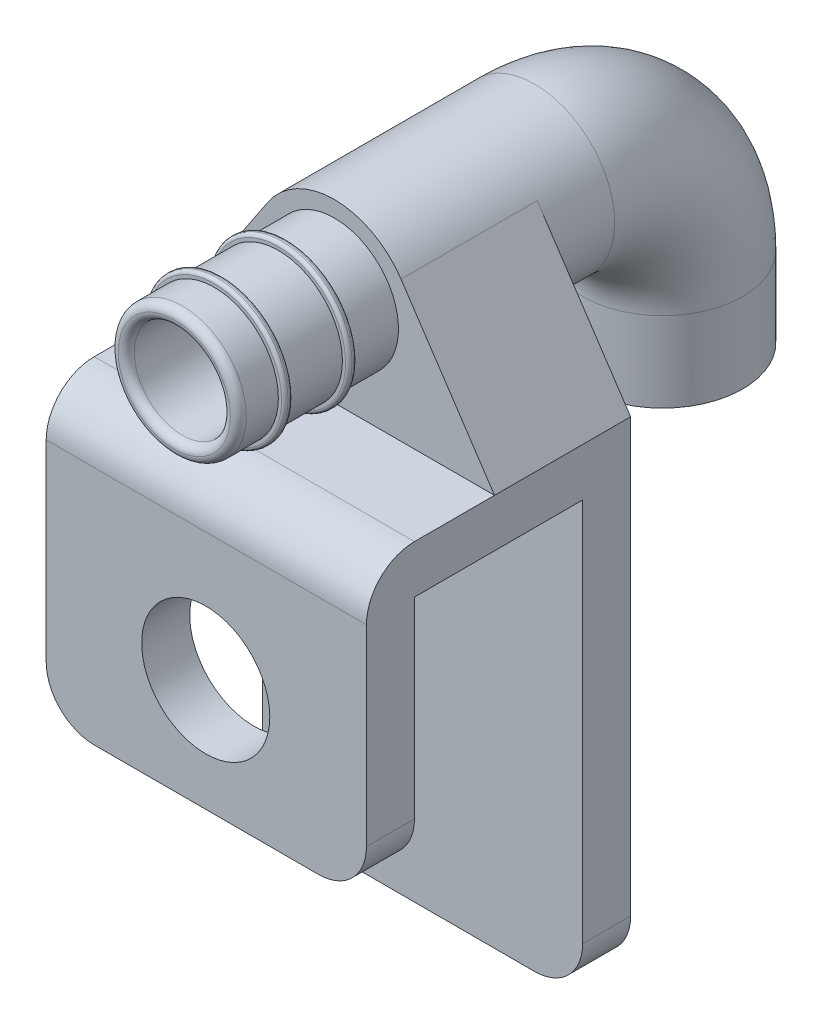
ISO-10303-21;
HEADER;
FILE_DESCRIPTION(('STEP AP214'),'2;1');
FILE_NAME('part.step','',(''),(''),'','','');
FILE_SCHEMA(('AUTOMOTIVE_DESIGN { 1 0 10303 214 1 1 1 1 }'));
ENDSEC;
DATA;
#1=APPLICATION_CONTEXT('core data for automotive mechanical design processes');
#2=APPLICATION_PROTOCOL_DEFINITION('international standard','automotive_design',2000,#1);
#3=PRODUCT_CONTEXT('',#1,'mechanical');
#4=PRODUCT('Part','Part','',(#3));
#5=PRODUCT_RELATED_PRODUCT_CATEGORY('part','',(#4));
#6=PRODUCT_DEFINITION_FORMATION('','',#4);
#7=PRODUCT_DEFINITION_CONTEXT('part definition',#1,'design');
#8=PRODUCT_DEFINITION('design','',#6,#7);
#9=PRODUCT_DEFINITION_SHAPE('','',#8);
#10=(LENGTH_UNIT() NAMED_UNIT(*) SI_UNIT(.MILLI.,.METRE.));
#11=(NAMED_UNIT(*) PLANE_ANGLE_UNIT() SI_UNIT($,.RADIAN.));
#12=(NAMED_UNIT(*) SI_UNIT($,.STERADIAN.) SOLID_ANGLE_UNIT());
#13=UNCERTAINTY_MEASURE_WITH_UNIT(LENGTH_MEASURE(1.E-05),#10,'distance_accuracy_value','');
#14=(GEOMETRIC_REPRESENTATION_CONTEXT(3) GLOBAL_UNCERTAINTY_ASSIGNED_CONTEXT((#13)) GLOBAL_UNIT_ASSIGNED_CONTEXT((#10,
#11,#12)) REPRESENTATION_CONTEXT('',''));
#15=CARTESIAN_POINT('',(0.,0.,0.));
#16=DIRECTION('',(0.,0.,1.));
#17=DIRECTION('',(1.,0.,0.));
#18=AXIS2_PLACEMENT_3D('',#15,#16,#17);
#19=CARTESIAN_POINT('',(20.,-12.,-13.5));
#20=DIRECTION('',(0.,0.,1.));
#21=DIRECTION('',(1.,0.,0.));
#22=AXIS2_PLACEMENT_3D('',#19,#20,#21);
#23=PLANE('',#22);
#24=DIRECTION('',(-1.,0.,0.));
#25=VECTOR('',#24,1.);
#26=CARTESIAN_POINT('',(20.,-12.,-13.5));
#27=LINE('',#26,#25);
#28=CARTESIAN_POINT('',(17.,-12.,-13.5));
#29=VERTEX_POINT('',#28);
#30=CARTESIAN_POINT('',(3.,-12.,-13.5));
#31=VERTEX_POINT('',#30);
#32=EDGE_CURVE('E279',#29,#31,#27,.T.);
#33=ORIENTED_EDGE('',*,*,#32,.T.);
#34=CARTESIAN_POINT('',(3.,-9.,-13.5));
#35=DIRECTION('',(0.,0.,1.));
#36=DIRECTION('',(1.,0.,0.));
#37=AXIS2_PLACEMENT_3D('',#34,#35,#36);
#38=CIRCLE('',#37,3.);
#39=CARTESIAN_POINT('',(0.,-9.,-13.5));
#40=VERTEX_POINT('',#39);
#41=EDGE_CURVE('E344',#31,#40,#38,.F.);
#42=ORIENTED_EDGE('',*,*,#41,.T.);
#43=DIRECTION('',(0.,1.,0.));
#44=VECTOR('',#43,1.);
#45=CARTESIAN_POINT('',(0.,-12.,-13.5));
#46=LINE('',#45,#44);
#47=CARTESIAN_POINT('',(0.,18.,-13.5));
#48=VERTEX_POINT('',#47);
#49=EDGE_CURVE('E161',#40,#48,#46,.T.);
#50=ORIENTED_EDGE('',*,*,#49,.T.);
#51=DIRECTION('',(0.55409218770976,0.832455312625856,0.));
#52=VECTOR('',#51,1.);
#53=CARTESIAN_POINT('',(0.,18.,-13.5));
#54=LINE('',#53,#52);
#55=CARTESIAN_POINT('',(5.83772343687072,26.7704609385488,-13.5));
#56=VERTEX_POINT('',#55);
#57=EDGE_CURVE('E145',#48,#56,#54,.T.);
#58=ORIENTED_EDGE('',*,*,#57,.T.);
#59=CARTESIAN_POINT('',(10.,24.,-13.5));
#60=DIRECTION('',(0.,0.,-1.));
#61=DIRECTION('',(-1.,0.,0.));
#62=AXIS2_PLACEMENT_3D('',#59,#60,#61);
#63=CIRCLE('',#62,5.);
#64=CARTESIAN_POINT('',(14.1622765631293,26.7704609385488,-13.5));
#65=VERTEX_POINT('',#64);
#66=EDGE_CURVE('E158',#65,#56,#63,.T.);
#67=ORIENTED_EDGE('',*,*,#66,.F.);
#68=DIRECTION('',(0.55409218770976,-0.832455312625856,0.));
#69=VECTOR('',#68,1.);
#70=CARTESIAN_POINT('',(14.1622765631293,26.7704609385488,-13.5));
#71=LINE('',#70,#69);
#72=CARTESIAN_POINT('',(20.,18.,-13.5));
#73=VERTEX_POINT('',#72);
#74=EDGE_CURVE('E164',#65,#73,#71,.T.);
#75=ORIENTED_EDGE('',*,*,#74,.T.);
#76=DIRECTION('',(0.,1.,0.));
#77=VECTOR('',#76,1.);
#78=CARTESIAN_POINT('',(20.,-12.,-13.5));
#79=LINE('',#78,#77);
#80=CARTESIAN_POINT('',(20.,-9.,-13.5));
#81=VERTEX_POINT('',#80);
#82=EDGE_CURVE('E267',#81,#73,#79,.T.);
#83=ORIENTED_EDGE('',*,*,#82,.F.);
#84=CARTESIAN_POINT('',(17.,-9.,-13.5));
#85=DIRECTION('',(0.,0.,1.));
#86=DIRECTION('',(1.,0.,0.));
#87=AXIS2_PLACEMENT_3D('',#84,#85,#86);
#88=CIRCLE('',#87,3.);
#89=EDGE_CURVE('E346',#81,#29,#88,.F.);
#90=ORIENTED_EDGE('',*,*,#89,.T.);
#91=EDGE_LOOP('',(#33,#42,#50,#58,#67,#75,#83,#90));
#92=FACE_BOUND('',#91,.T.);
#93=ADVANCED_FACE('F27',(#92),#23,.F.);
#94=CARTESIAN_POINT('',(10.,24.,5.));
#95=DIRECTION('',(0.,0.,-1.));
#96=DIRECTION('',(-1.,0.,0.));
#97=AXIS2_PLACEMENT_3D('',#94,#95,#96);
#98=CYLINDRICAL_SURFACE('',#97,4.);
#99=CARTESIAN_POINT('',(10.,24.,-1.5));
#100=DIRECTION('',(0.,0.,1.));
#101=DIRECTION('',(1.,0.,0.));
#102=AXIS2_PLACEMENT_3D('',#99,#100,#101);
#103=CIRCLE('',#102,4.);
#104=CARTESIAN_POINT('',(14.,24.,-1.5));
#105=VERTEX_POINT('',#104);
#106=EDGE_CURVE('E204',#105,#105,#103,.T.);
#107=ORIENTED_EDGE('',*,*,#106,.T.);
#108=EDGE_LOOP('',(#107));
#109=FACE_BOUND('',#108,.T.);
#110=CARTESIAN_POINT('',(10.,24.,2.));
#111=DIRECTION('',(0.,0.,1.));
#112=DIRECTION('',(1.,0.,0.));
#113=AXIS2_PLACEMENT_3D('',#110,#111,#112);
#114=CIRCLE('',#113,4.);
#115=CARTESIAN_POINT('',(14.,24.,2.));
#116=VERTEX_POINT('',#115);
#117=EDGE_CURVE('E200',#116,#116,#114,.T.);
#118=ORIENTED_EDGE('',*,*,#117,.F.);
#119=EDGE_LOOP('',(#118));
#120=FACE_BOUND('',#119,.T.);
#121=ADVANCED_FACE('F409',(#109,#120),#98,.T.);
#122=CARTESIAN_POINT('',(10.,24.,-5.));
#123=DIRECTION('',(0.,0.,-1.));
#124=DIRECTION('',(-1.,0.,0.));
#125=AXIS2_PLACEMENT_3D('',#122,#123,#124);
#126=CIRCLE('',#125,4.);
#127=CARTESIAN_POINT('',(6.,24.,-5.));
#128=VERTEX_POINT('',#127);
#129=EDGE_CURVE('E226',#128,#128,#126,.F.);
#130=ORIENTED_EDGE('',*,*,#129,.T.);
#131=EDGE_LOOP('',(#130));
#132=FACE_BOUND('',#131,.T.);
#133=CARTESIAN_POINT('',(10.,24.,-2.));
#134=DIRECTION('',(0.,0.,1.));
#135=DIRECTION('',(1.,0.,0.));
#136=AXIS2_PLACEMENT_3D('',#133,#134,#135);
#137=CIRCLE('',#136,4.);
#138=CARTESIAN_POINT('',(14.,24.,-2.));
#139=VERTEX_POINT('',#138);
#140=EDGE_CURVE('E220',#139,#139,#137,.T.);
#141=ORIENTED_EDGE('',*,*,#140,.F.);
#142=EDGE_LOOP('',(#141));
#143=FACE_BOUND('',#142,.T.);
#144=ADVANCED_FACE('F416',(#132,#143),#98,.T.);
#145=CARTESIAN_POINT('',(10.,24.,-5.));
#146=DIRECTION('',(0.,0.,-1.));
#147=DIRECTION('',(-1.,0.,0.));
#148=AXIS2_PLACEMENT_3D('',#145,#146,#147);
#149=PLANE('',#148);
#150=CARTESIAN_POINT('',(10.,24.,-5.));
#151=DIRECTION('',(0.,0.,1.));
#152=DIRECTION('',(-1.,0.,0.));
#153=AXIS2_PLACEMENT_3D('',#150,#151,#152);
#154=CIRCLE('',#153,5.);
#155=CARTESIAN_POINT('',(14.1622765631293,26.7704609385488,-5.));
#156=VERTEX_POINT('',#155);
#157=CARTESIAN_POINT('',(5.83772343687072,26.7704609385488,-5.));
#158=VERTEX_POINT('',#157);
#159=EDGE_CURVE('E223',#156,#158,#154,.T.);
#160=ORIENTED_EDGE('',*,*,#159,.T.);
#161=DIRECTION('',(-0.55409218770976,-0.832455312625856,0.));
#162=VECTOR('',#161,1.);
#163=CARTESIAN_POINT('',(0.,18.,-5.));
#164=LINE('',#163,#162);
#165=CARTESIAN_POINT('',(0.,18.,-5.));
#166=VERTEX_POINT('',#165);
#167=EDGE_CURVE('E147',#158,#166,#164,.T.);
#168=ORIENTED_EDGE('',*,*,#167,.T.);
#169=DIRECTION('',(1.,0.,0.));
#170=VECTOR('',#169,1.);
#171=CARTESIAN_POINT('',(20.,18.,-5.));
#172=LINE('',#171,#170);
#173=CARTESIAN_POINT('',(20.,18.,-5.));
#174=VERTEX_POINT('',#173);
#175=EDGE_CURVE('E233',#166,#174,#172,.T.);
#176=ORIENTED_EDGE('',*,*,#175,.T.);
#177=DIRECTION('',(-0.55409218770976,0.832455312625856,0.));
#178=VECTOR('',#177,1.);
#179=CARTESIAN_POINT('',(14.1622765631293,26.7704609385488,-5.));
#180=LINE('',#179,#178);
#181=EDGE_CURVE('E153',#174,#156,#180,.T.);
#182=ORIENTED_EDGE('',*,*,#181,.T.);
#183=EDGE_LOOP('',(#160,#168,#176,#182));
#184=FACE_BOUND('',#183,.T.);
#185=ORIENTED_EDGE('',*,*,#129,.F.);
#186=EDGE_LOOP('',(#185));
#187=FACE_BOUND('',#186,.T.);
#188=ADVANCED_FACE('F358',(#184,#187),#149,.F.);
#189=CARTESIAN_POINT('',(20.,18.,3.));
#190=DIRECTION('',(0.,-1.,0.));
#191=DIRECTION('',(0.,0.,-1.));
#192=AXIS2_PLACEMENT_3D('',#189,#190,#191);
#193=PLANE('',#192);
#194=DIRECTION('',(0.,0.,1.));
#195=VECTOR('',#194,1.);
#196=CARTESIAN_POINT('',(0.,18.,3.));
#197=LINE('',#196,#195);
#198=CARTESIAN_POINT('',(0.,18.,0.));
#199=VERTEX_POINT('',#198);
#200=EDGE_CURVE('E255',#166,#199,#197,.T.);
#201=ORIENTED_EDGE('',*,*,#200,.T.);
#202=DIRECTION('',(-1.,0.,0.));
#203=VECTOR('',#202,1.);
#204=CARTESIAN_POINT('',(20.,18.,0.));
#205=LINE('',#204,#203);
#206=CARTESIAN_POINT('',(20.,18.,0.));
#207=VERTEX_POINT('',#206);
#208=EDGE_CURVE('E307',#199,#207,#205,.F.);
#209=ORIENTED_EDGE('',*,*,#208,.T.);
#210=DIRECTION('',(0.,0.,1.));
#211=VECTOR('',#210,1.);
#212=CARTESIAN_POINT('',(20.,18.,3.));
#213=LINE('',#212,#211);
#214=EDGE_CURVE('E265',#174,#207,#213,.T.);
#215=ORIENTED_EDGE('',*,*,#214,.F.);
#216=ORIENTED_EDGE('',*,*,#175,.F.);
#217=EDGE_LOOP('',(#201,#209,#215,#216));
#218=FACE_BOUND('',#217,.T.);
#219=ADVANCED_FACE('F319',(#218),#193,.F.);
#220=CARTESIAN_POINT('',(20.,0.,3.));
#221=DIRECTION('',(0.,1.,0.));
#222=DIRECTION('',(0.,0.,1.));
#223=AXIS2_PLACEMENT_3D('',#220,#221,#222);
#224=PLANE('',#223);
#225=DIRECTION('',(-1.,0.,0.));
#226=VECTOR('',#225,1.);
#227=CARTESIAN_POINT('',(20.,0.,0.));
#228=LINE('',#227,#226);
#229=CARTESIAN_POINT('',(17.,0.,0.));
#230=VERTEX_POINT('',#229);
#231=CARTESIAN_POINT('',(3.,0.,0.));
#232=VERTEX_POINT('',#231);
#233=EDGE_CURVE('E229',#230,#232,#228,.T.);
#234=ORIENTED_EDGE('',*,*,#233,.F.);
#235=DIRECTION('',(0.,0.,-1.));
#236=VECTOR('',#235,1.);
#237=CARTESIAN_POINT('',(17.,0.,3.));
#238=LINE('',#237,#236);
#239=CARTESIAN_POINT('',(17.,0.,3.));
#240=VERTEX_POINT('',#239);
#241=EDGE_CURVE('E11',#230,#240,#238,.F.);
#242=ORIENTED_EDGE('',*,*,#241,.T.);
#243=DIRECTION('',(-1.,0.,0.));
#244=VECTOR('',#243,1.);
#245=CARTESIAN_POINT('',(20.,0.,3.));
#246=LINE('',#245,#244);
#247=CARTESIAN_POINT('',(3.,0.,3.));
#248=VERTEX_POINT('',#247);
#249=EDGE_CURVE('E276',#240,#248,#246,.T.);
#250=ORIENTED_EDGE('',*,*,#249,.T.);
#251=DIRECTION('',(0.,0.,-1.));
#252=VECTOR('',#251,1.);
#253=CARTESIAN_POINT('',(3.,0.,3.));
#254=LINE('',#253,#252);
#255=EDGE_CURVE('E35',#248,#232,#254,.T.);
#256=ORIENTED_EDGE('',*,*,#255,.T.);
#257=EDGE_LOOP('',(#234,#242,#250,#256));
#258=FACE_BOUND('',#257,.T.);
#259=ADVANCED_FACE('F29',(#258),#224,.F.);
#260=CARTESIAN_POINT('',(20.,0.,0.));
#261=DIRECTION('',(0.,0.,1.));
#262=DIRECTION('',(1.,0.,0.));
#263=AXIS2_PLACEMENT_3D('',#260,#261,#262);
#264=PLANE('',#263);
#265=CARTESIAN_POINT('',(9.96355555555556,7.,0.));
#266=DIRECTION('',(0.,0.,1.));
#267=DIRECTION('',(1.,0.,0.));
#268=AXIS2_PLACEMENT_3D('',#265,#266,#267);
#269=CIRCLE('',#268,4.);
#270=CARTESIAN_POINT('',(13.9635555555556,7.,0.));
#271=VERTEX_POINT('',#270);
#272=EDGE_CURVE('E435',#271,#271,#269,.T.);
#273=ORIENTED_EDGE('',*,*,#272,.T.);
#274=EDGE_LOOP('',(#273));
#275=FACE_BOUND('',#274,.T.);
#276=DIRECTION('',(0.,1.,0.));
#277=VECTOR('',#276,1.);
#278=CARTESIAN_POINT('',(20.,0.,0.));
#279=LINE('',#278,#277);
#280=CARTESIAN_POINT('',(20.,3.,0.));
#281=VERTEX_POINT('',#280);
#282=CARTESIAN_POINT('',(20.,15.,0.));
#283=VERTEX_POINT('',#282);
#284=EDGE_CURVE('E366',#281,#283,#279,.T.);
#285=ORIENTED_EDGE('',*,*,#284,.F.);
#286=CARTESIAN_POINT('',(17.,3.,0.));
#287=DIRECTION('',(0.,0.,1.));
#288=DIRECTION('',(1.,0.,0.));
#289=AXIS2_PLACEMENT_3D('',#286,#287,#288);
#290=CIRCLE('',#289,3.);
#291=EDGE_CURVE('E50',#281,#230,#290,.F.);
#292=ORIENTED_EDGE('',*,*,#291,.T.);
#293=ORIENTED_EDGE('',*,*,#233,.T.);
#294=CARTESIAN_POINT('',(3.,3.,0.));
#295=DIRECTION('',(0.,0.,1.));
#296=DIRECTION('',(1.,0.,0.));
#297=AXIS2_PLACEMENT_3D('',#294,#295,#296);
#298=CIRCLE('',#297,3.);
#299=CARTESIAN_POINT('',(0.,3.,0.));
#300=VERTEX_POINT('',#299);
#301=EDGE_CURVE('E42',#232,#300,#298,.F.);
#302=ORIENTED_EDGE('',*,*,#301,.T.);
#303=DIRECTION('',(0.,1.,0.));
#304=VECTOR('',#303,1.);
#305=CARTESIAN_POINT('',(0.,0.,0.));
#306=LINE('',#305,#304);
#307=CARTESIAN_POINT('',(0.,15.,0.));
#308=VERTEX_POINT('',#307);
#309=EDGE_CURVE('E163',#300,#308,#306,.T.);
#310=ORIENTED_EDGE('',*,*,#309,.T.);
#311=DIRECTION('',(-1.,0.,0.));
#312=VECTOR('',#311,1.);
#313=CARTESIAN_POINT('',(20.,15.,0.));
#314=LINE('',#313,#312);
#315=EDGE_CURVE('E287',#283,#308,#314,.T.);
#316=ORIENTED_EDGE('',*,*,#315,.F.);
#317=EDGE_LOOP('',(#285,#292,#293,#302,#310,#316));
#318=FACE_BOUND('',#317,.T.);
#319=ADVANCED_FACE('F289',(#275,#318),#264,.F.);
#320=CARTESIAN_POINT('',(20.,15.,0.));
#321=DIRECTION('',(0.,1.,0.));
#322=DIRECTION('',(0.,0.,1.));
#323=AXIS2_PLACEMENT_3D('',#320,#321,#322);
#324=PLANE('',#323);
#325=DIRECTION('',(0.,0.,-1.));
#326=VECTOR('',#325,1.);
#327=CARTESIAN_POINT('',(0.,15.,0.));
#328=LINE('',#327,#326);
#329=CARTESIAN_POINT('',(0.,15.,-10.5));
#330=VERTEX_POINT('',#329);
#331=EDGE_CURVE('E249',#308,#330,#328,.T.);
#332=ORIENTED_EDGE('',*,*,#331,.T.);
#333=DIRECTION('',(-1.,0.,0.));
#334=VECTOR('',#333,1.);
#335=CARTESIAN_POINT('',(20.,15.,-10.5));
#336=LINE('',#335,#334);
#337=CARTESIAN_POINT('',(20.,15.,-10.5));
#338=VERTEX_POINT('',#337);
#339=EDGE_CURVE('E284',#338,#330,#336,.T.);
#340=ORIENTED_EDGE('',*,*,#339,.F.);
#341=DIRECTION('',(0.,0.,-1.));
#342=VECTOR('',#341,1.);
#343=CARTESIAN_POINT('',(20.,15.,0.));
#344=LINE('',#343,#342);
#345=EDGE_CURVE('E369',#283,#338,#344,.T.);
#346=ORIENTED_EDGE('',*,*,#345,.F.);
#347=ORIENTED_EDGE('',*,*,#315,.T.);
#348=EDGE_LOOP('',(#332,#340,#346,#347));
#349=FACE_BOUND('',#348,.T.);
#350=ADVANCED_FACE('F393',(#349),#324,.F.);
#351=CARTESIAN_POINT('',(20.,-12.,-10.5));
#352=DIRECTION('',(0.,0.,-1.));
#353=DIRECTION('',(0.,1.,0.));
#354=AXIS2_PLACEMENT_3D('',#351,#352,#353);
#355=PLANE('',#354);
#356=DIRECTION('',(0.,-1.,0.));
#357=VECTOR('',#356,1.);
#358=CARTESIAN_POINT('',(0.,-12.,-10.5));
#359=LINE('',#358,#357);
#360=CARTESIAN_POINT('',(0.,-9.,-10.5));
#361=VERTEX_POINT('',#360);
#362=EDGE_CURVE('E251',#330,#361,#359,.T.);
#363=ORIENTED_EDGE('',*,*,#362,.T.);
#364=CARTESIAN_POINT('',(3.,-9.,-10.5));
#365=DIRECTION('',(0.,0.,-1.));
#366=DIRECTION('',(0.,1.,0.));
#367=AXIS2_PLACEMENT_3D('',#364,#365,#366);
#368=CIRCLE('',#367,3.);
#369=CARTESIAN_POINT('',(3.,-12.,-10.5));
#370=VERTEX_POINT('',#369);
#371=EDGE_CURVE('E332',#361,#370,#368,.F.);
#372=ORIENTED_EDGE('',*,*,#371,.T.);
#373=DIRECTION('',(-1.,0.,0.));
#374=VECTOR('',#373,1.);
#375=CARTESIAN_POINT('',(20.,-12.,-10.5));
#376=LINE('',#375,#374);
#377=CARTESIAN_POINT('',(17.,-12.,-10.5));
#378=VERTEX_POINT('',#377);
#379=EDGE_CURVE('E281',#378,#370,#376,.T.);
#380=ORIENTED_EDGE('',*,*,#379,.F.);
#381=CARTESIAN_POINT('',(17.,-9.,-10.5));
#382=DIRECTION('',(0.,0.,-1.));
#383=DIRECTION('',(0.,1.,0.));
#384=AXIS2_PLACEMENT_3D('',#381,#382,#383);
#385=CIRCLE('',#384,3.);
#386=CARTESIAN_POINT('',(20.,-9.,-10.5));
#387=VERTEX_POINT('',#386);
#388=EDGE_CURVE('E336',#378,#387,#385,.F.);
#389=ORIENTED_EDGE('',*,*,#388,.T.);
#390=DIRECTION('',(0.,-1.,0.));
#391=VECTOR('',#390,1.);
#392=CARTESIAN_POINT('',(20.,-12.,-10.5));
#393=LINE('',#392,#391);
#394=EDGE_CURVE('E370',#338,#387,#393,.T.);
#395=ORIENTED_EDGE('',*,*,#394,.F.);
#396=ORIENTED_EDGE('',*,*,#339,.T.);
#397=EDGE_LOOP('',(#363,#372,#380,#389,#395,#396));
#398=FACE_BOUND('',#397,.T.);
#399=ADVANCED_FACE('F390',(#398),#355,.F.);
#400=CARTESIAN_POINT('',(20.,-12.,-10.5));
#401=DIRECTION('',(0.,1.,0.));
#402=DIRECTION('',(0.,0.,1.));
#403=AXIS2_PLACEMENT_3D('',#400,#401,#402);
#404=PLANE('',#403);
#405=ORIENTED_EDGE('',*,*,#379,.T.);
#406=DIRECTION('',(0.,0.,-1.));
#407=VECTOR('',#406,1.);
#408=CARTESIAN_POINT('',(3.,-12.,-10.5));
#409=LINE('',#408,#407);
#410=EDGE_CURVE('E172',#370,#31,#409,.T.);
#411=ORIENTED_EDGE('',*,*,#410,.T.);
#412=ORIENTED_EDGE('',*,*,#32,.F.);
#413=DIRECTION('',(0.,0.,-1.));
#414=VECTOR('',#413,1.);
#415=CARTESIAN_POINT('',(17.,-12.,-10.5));
#416=LINE('',#415,#414);
#417=EDGE_CURVE('E169',#29,#378,#416,.F.);
#418=ORIENTED_EDGE('',*,*,#417,.T.);
#419=EDGE_LOOP('',(#405,#411,#412,#418));
#420=FACE_BOUND('',#419,.T.);
#421=ADVANCED_FACE('F380',(#420),#404,.F.);
#422=CARTESIAN_POINT('',(20.,0.,3.));
#423=DIRECTION('',(0.,0.,-1.));
#424=DIRECTION('',(-1.,0.,0.));
#425=AXIS2_PLACEMENT_3D('',#422,#423,#424);
#426=PLANE('',#425);
#427=CARTESIAN_POINT('',(9.96355555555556,7.,3.));
#428=DIRECTION('',(0.,0.,1.));
#429=DIRECTION('',(1.,0.,0.));
#430=AXIS2_PLACEMENT_3D('',#427,#428,#429);
#431=CIRCLE('',#430,4.);
#432=CARTESIAN_POINT('',(13.9635555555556,7.,3.));
#433=VERTEX_POINT('',#432);
#434=EDGE_CURVE('E438',#433,#433,#431,.T.);
#435=ORIENTED_EDGE('',*,*,#434,.F.);
#436=EDGE_LOOP('',(#435));
#437=FACE_BOUND('',#436,.T.);
#438=DIRECTION('',(0.,-1.,0.));
#439=VECTOR('',#438,1.);
#440=CARTESIAN_POINT('',(20.,0.,3.));
#441=LINE('',#440,#439);
#442=CARTESIAN_POINT('',(20.,15.,3.));
#443=VERTEX_POINT('',#442);
#444=CARTESIAN_POINT('',(20.,3.,3.));
#445=VERTEX_POINT('',#444);
#446=EDGE_CURVE('E272',#443,#445,#441,.T.);
#447=ORIENTED_EDGE('',*,*,#446,.F.);
#448=DIRECTION('',(-1.,0.,0.));
#449=VECTOR('',#448,1.);
#450=CARTESIAN_POINT('',(20.,15.,3.));
#451=LINE('',#450,#449);
#452=CARTESIAN_POINT('',(0.,15.,3.));
#453=VERTEX_POINT('',#452);
#454=EDGE_CURVE('E303',#443,#453,#451,.T.);
#455=ORIENTED_EDGE('',*,*,#454,.T.);
#456=DIRECTION('',(0.,-1.,0.));
#457=VECTOR('',#456,1.);
#458=CARTESIAN_POINT('',(0.,0.,3.));
#459=LINE('',#458,#457);
#460=CARTESIAN_POINT('',(0.,3.,3.));
#461=VERTEX_POINT('',#460);
#462=EDGE_CURVE('E258',#453,#461,#459,.T.);
#463=ORIENTED_EDGE('',*,*,#462,.T.);
#464=CARTESIAN_POINT('',(3.,3.,3.));
#465=DIRECTION('',(0.,0.,-1.));
#466=DIRECTION('',(-1.,0.,0.));
#467=AXIS2_PLACEMENT_3D('',#464,#465,#466);
#468=CIRCLE('',#467,3.);
#469=EDGE_CURVE('E304',#461,#248,#468,.F.);
#470=ORIENTED_EDGE('',*,*,#469,.T.);
#471=ORIENTED_EDGE('',*,*,#249,.F.);
#472=CARTESIAN_POINT('',(17.,3.,3.));
#473=DIRECTION('',(0.,0.,-1.));
#474=DIRECTION('',(-1.,0.,0.));
#475=AXIS2_PLACEMENT_3D('',#472,#473,#474);
#476=CIRCLE('',#475,3.);
#477=EDGE_CURVE('E299',#240,#445,#476,.F.);
#478=ORIENTED_EDGE('',*,*,#477,.T.);
#479=EDGE_LOOP('',(#447,#455,#463,#470,#471,#478));
#480=FACE_BOUND('',#479,.T.);
#481=ADVANCED_FACE('F364',(#437,#480),#426,.F.);
#482=CARTESIAN_POINT('',(20.,0.,0.));
#483=DIRECTION('',(1.,0.,0.));
#484=DIRECTION('',(0.,0.,-1.));
#485=AXIS2_PLACEMENT_3D('',#482,#483,#484);
#486=PLANE('',#485);
#487=ORIENTED_EDGE('',*,*,#394,.T.);
#488=DIRECTION('',(0.,0.,-1.));
#489=VECTOR('',#488,1.);
#490=CARTESIAN_POINT('',(20.,-9.,-13.5));
#491=LINE('',#490,#489);
#492=EDGE_CURVE('E309',#387,#81,#491,.T.);
#493=ORIENTED_EDGE('',*,*,#492,.T.);
#494=ORIENTED_EDGE('',*,*,#82,.T.);
#495=EDGE_CURVE('E241',#73,#174,#213,.T.);
#496=ORIENTED_EDGE('',*,*,#495,.T.);
#497=ORIENTED_EDGE('',*,*,#214,.T.);
#498=CARTESIAN_POINT('',(20.,15.,0.));
#499=DIRECTION('',(1.,0.,0.));
#500=DIRECTION('',(0.,0.,-1.));
#501=AXIS2_PLACEMENT_3D('',#498,#499,#500);
#502=CIRCLE('',#501,3.);
#503=EDGE_CURVE('E326',#207,#443,#502,.T.);
#504=ORIENTED_EDGE('',*,*,#503,.T.);
#505=ORIENTED_EDGE('',*,*,#446,.T.);
#506=DIRECTION('',(0.,0.,-1.));
#507=VECTOR('',#506,1.);
#508=CARTESIAN_POINT('',(20.,3.,0.));
#509=LINE('',#508,#507);
#510=EDGE_CURVE('E300',#445,#281,#509,.T.);
#511=ORIENTED_EDGE('',*,*,#510,.T.);
#512=ORIENTED_EDGE('',*,*,#284,.T.);
#513=ORIENTED_EDGE('',*,*,#345,.T.);
#514=EDGE_LOOP('',(#487,#493,#494,#496,#497,#504,#505,#511,#512,#513));
#515=FACE_BOUND('',#514,.T.);
#516=ADVANCED_FACE('F325',(#515),#486,.T.);
#517=CARTESIAN_POINT('',(0.,0.,0.));
#518=DIRECTION('',(1.,0.,0.));
#519=DIRECTION('',(0.,0.,-1.));
#520=AXIS2_PLACEMENT_3D('',#517,#518,#519);
#521=PLANE('',#520);
#522=ORIENTED_EDGE('',*,*,#49,.F.);
#523=DIRECTION('',(0.,0.,-1.));
#524=VECTOR('',#523,1.);
#525=CARTESIAN_POINT('',(0.,-9.,0.));
#526=LINE('',#525,#524);
#527=EDGE_CURVE('E338',#40,#361,#526,.F.);
#528=ORIENTED_EDGE('',*,*,#527,.T.);
#529=ORIENTED_EDGE('',*,*,#362,.F.);
#530=ORIENTED_EDGE('',*,*,#331,.F.);
#531=ORIENTED_EDGE('',*,*,#309,.F.);
#532=DIRECTION('',(0.,0.,-1.));
#533=VECTOR('',#532,1.);
#534=CARTESIAN_POINT('',(0.,3.,0.));
#535=LINE('',#534,#533);
#536=EDGE_CURVE('E342',#300,#461,#535,.F.);
#537=ORIENTED_EDGE('',*,*,#536,.T.);
#538=ORIENTED_EDGE('',*,*,#462,.F.);
#539=CARTESIAN_POINT('',(0.,15.,0.));
#540=DIRECTION('',(1.,0.,0.));
#541=DIRECTION('',(0.,0.,-1.));
#542=AXIS2_PLACEMENT_3D('',#539,#540,#541);
#543=CIRCLE('',#542,3.);
#544=EDGE_CURVE('E340',#453,#199,#543,.F.);
#545=ORIENTED_EDGE('',*,*,#544,.T.);
#546=ORIENTED_EDGE('',*,*,#200,.F.);
#547=EDGE_CURVE('E264',#48,#166,#197,.T.);
#548=ORIENTED_EDGE('',*,*,#547,.F.);
#549=EDGE_LOOP('',(#522,#528,#529,#530,#531,#537,#538,#545,#546,#548));
#550=FACE_BOUND('',#549,.T.);
#551=ADVANCED_FACE('F361',(#550),#521,.F.);
#552=CARTESIAN_POINT('',(0.,18.,-36.3254244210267));
#553=DIRECTION('',(-0.832455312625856,0.55409218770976,0.));
#554=DIRECTION('',(-0.55409218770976,-0.832455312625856,0.));
#555=AXIS2_PLACEMENT_3D('',#552,#553,#554);
#556=PLANE('',#555);
#557=ORIENTED_EDGE('',*,*,#57,.F.);
#558=ORIENTED_EDGE('',*,*,#547,.T.);
#559=ORIENTED_EDGE('',*,*,#167,.F.);
#560=DIRECTION('',(0.,0.,1.));
#561=VECTOR('',#560,1.);
#562=CARTESIAN_POINT('',(5.83772343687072,26.7704609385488,-36.3254244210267));
#563=LINE('',#562,#561);
#564=EDGE_CURVE('E141',#56,#158,#563,.T.);
#565=ORIENTED_EDGE('',*,*,#564,.F.);
#566=EDGE_LOOP('',(#557,#558,#559,#565));
#567=FACE_BOUND('',#566,.T.);
#568=ADVANCED_FACE('F143',(#567),#556,.T.);
#569=CARTESIAN_POINT('',(14.1622765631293,26.7704609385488,-36.3254244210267));
#570=DIRECTION('',(0.832455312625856,0.55409218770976,0.));
#571=DIRECTION('',(-0.55409218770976,0.832455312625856,0.));
#572=AXIS2_PLACEMENT_3D('',#569,#570,#571);
#573=PLANE('',#572);
#574=ORIENTED_EDGE('',*,*,#74,.F.);
#575=DIRECTION('',(0.,0.,1.));
#576=VECTOR('',#575,1.);
#577=CARTESIAN_POINT('',(14.1622765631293,26.7704609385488,-36.3254244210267));
#578=LINE('',#577,#576);
#579=EDGE_CURVE('E152',#65,#156,#578,.T.);
#580=ORIENTED_EDGE('',*,*,#579,.T.);
#581=ORIENTED_EDGE('',*,*,#181,.F.);
#582=ORIENTED_EDGE('',*,*,#495,.F.);
#583=EDGE_LOOP('',(#574,#580,#581,#582));
#584=FACE_BOUND('',#583,.T.);
#585=ADVANCED_FACE('F356',(#584),#573,.T.);
#586=CARTESIAN_POINT('',(10.,24.,-36.3254244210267));
#587=DIRECTION('',(0.,0.,1.));
#588=DIRECTION('',(1.,0.,0.));
#589=AXIS2_PLACEMENT_3D('',#586,#587,#588);
#590=CYLINDRICAL_SURFACE('',#589,5.);
#591=ORIENTED_EDGE('',*,*,#579,.F.);
#592=ORIENTED_EDGE('',*,*,#66,.T.);
#593=ORIENTED_EDGE('',*,*,#564,.T.);
#594=ORIENTED_EDGE('',*,*,#159,.F.);
#595=EDGE_LOOP('',(#591,#592,#593,#594));
#596=FACE_BOUND('',#595,.T.);
#597=CARTESIAN_POINT('',(10.,24.,-17.5));
#598=DIRECTION('',(0.,0.,-1.));
#599=DIRECTION('',(-1.,0.,0.));
#600=AXIS2_PLACEMENT_3D('',#597,#598,#599);
#601=CIRCLE('',#600,5.);
#602=CARTESIAN_POINT('',(10.,29.,-17.5));
#603=VERTEX_POINT('',#602);
#604=EDGE_CURVE('E441',#603,#603,#601,.T.);
#605=ORIENTED_EDGE('',*,*,#604,.F.);
#606=EDGE_LOOP('',(#605));
#607=FACE_BOUND('',#606,.T.);
#608=ADVANCED_FACE('F167',(#596,#607),#590,.T.);
#609=CARTESIAN_POINT('',(10.,24.,-36.3254244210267));
#610=DIRECTION('',(0.,0.,1.));
#611=DIRECTION('',(1.,0.,0.));
#612=AXIS2_PLACEMENT_3D('',#609,#610,#611);
#613=CYLINDRICAL_SURFACE('',#612,3.);
#614=CARTESIAN_POINT('',(10.,24.,4.5));
#615=DIRECTION('',(0.,0.,1.));
#616=DIRECTION('',(1.,0.,0.));
#617=AXIS2_PLACEMENT_3D('',#614,#615,#616);
#618=CIRCLE('',#617,3.);
#619=CARTESIAN_POINT('',(13.,24.,4.5));
#620=VERTEX_POINT('',#619);
#621=EDGE_CURVE('E175',#620,#620,#618,.T.);
#622=ORIENTED_EDGE('',*,*,#621,.T.);
#623=EDGE_LOOP('',(#622));
#624=FACE_BOUND('',#623,.T.);
#625=CARTESIAN_POINT('',(10.,24.,-17.5));
#626=DIRECTION('',(0.,0.,-1.));
#627=DIRECTION('',(-1.,0.,0.));
#628=AXIS2_PLACEMENT_3D('',#625,#626,#627);
#629=CIRCLE('',#628,3.);
#630=CARTESIAN_POINT('',(10.,27.,-17.5));
#631=VERTEX_POINT('',#630);
#632=EDGE_CURVE('E437',#631,#631,#629,.T.);
#633=ORIENTED_EDGE('',*,*,#632,.T.);
#634=EDGE_LOOP('',(#633));
#635=FACE_BOUND('',#634,.T.);
#636=ADVANCED_FACE('F514',(#624,#635),#613,.F.);
#637=CARTESIAN_POINT('',(10.,24.,4.5));
#638=DIRECTION('',(0.,0.,1.));
#639=DIRECTION('',(1.,0.,0.));
#640=AXIS2_PLACEMENT_3D('',#637,#638,#639);
#641=CIRCLE('',#640,4.);
#642=CARTESIAN_POINT('',(14.,24.,4.5));
#643=VERTEX_POINT('',#642);
#644=EDGE_CURVE('E170',#643,#643,#641,.F.);
#645=ORIENTED_EDGE('',*,*,#644,.T.);
#646=EDGE_LOOP('',(#645));
#647=FACE_BOUND('',#646,.T.);
#648=CARTESIAN_POINT('',(10.,24.,2.5));
#649=DIRECTION('',(0.,0.,1.));
#650=DIRECTION('',(1.,0.,0.));
#651=AXIS2_PLACEMENT_3D('',#648,#649,#650);
#652=CIRCLE('',#651,4.);
#653=CARTESIAN_POINT('',(14.,24.,2.5));
#654=VERTEX_POINT('',#653);
#655=EDGE_CURVE('E201',#654,#654,#652,.T.);
#656=ORIENTED_EDGE('',*,*,#655,.T.);
#657=EDGE_LOOP('',(#656));
#658=FACE_BOUND('',#657,.T.);
#659=ADVANCED_FACE('F419',(#647,#658),#98,.T.);
#660=CARTESIAN_POINT('',(10.,24.,-1.5));
#661=DIRECTION('',(0.,0.,1.));
#662=DIRECTION('',(1.,0.,0.));
#663=AXIS2_PLACEMENT_3D('',#660,#661,#662);
#664=PLANE('',#663);
#665=CARTESIAN_POINT('',(10.,24.,-1.5));
#666=DIRECTION('',(0.,0.,1.));
#667=DIRECTION('',(1.,0.,0.));
#668=AXIS2_PLACEMENT_3D('',#665,#666,#667);
#669=CIRCLE('',#668,4.2);
#670=CARTESIAN_POINT('',(14.2,24.,-1.5));
#671=VERTEX_POINT('',#670);
#672=EDGE_CURVE('E217',#671,#671,#669,.T.);
#673=ORIENTED_EDGE('',*,*,#672,.T.);
#674=EDGE_LOOP('',(#673));
#675=FACE_BOUND('',#674,.T.);
#676=ORIENTED_EDGE('',*,*,#106,.F.);
#677=EDGE_LOOP('',(#676));
#678=FACE_BOUND('',#677,.T.);
#679=ADVANCED_FACE('F506',(#675,#678),#664,.T.);
#680=CARTESIAN_POINT('',(10.,24.,-2.));
#681=DIRECTION('',(0.,0.,1.));
#682=DIRECTION('',(1.,0.,0.));
#683=AXIS2_PLACEMENT_3D('',#680,#681,#682);
#684=PLANE('',#683);
#685=CARTESIAN_POINT('',(10.,24.,-2.));
#686=DIRECTION('',(0.,0.,1.));
#687=DIRECTION('',(1.,0.,0.));
#688=AXIS2_PLACEMENT_3D('',#685,#686,#687);
#689=CIRCLE('',#688,4.2);
#690=CARTESIAN_POINT('',(14.2,24.,-2.));
#691=VERTEX_POINT('',#690);
#692=EDGE_CURVE('E208',#691,#691,#689,.F.);
#693=ORIENTED_EDGE('',*,*,#692,.T.);
#694=EDGE_LOOP('',(#693));
#695=FACE_BOUND('',#694,.T.);
#696=ORIENTED_EDGE('',*,*,#140,.T.);
#697=EDGE_LOOP('',(#696));
#698=FACE_BOUND('',#697,.T.);
#699=ADVANCED_FACE('F503',(#695,#698),#684,.F.);
#700=CARTESIAN_POINT('',(10.,24.,-1.5));
#701=DIRECTION('',(0.,0.,-1.));
#702=DIRECTION('',(-1.,0.,0.));
#703=AXIS2_PLACEMENT_3D('',#700,#701,#702);
#704=CYLINDRICAL_SURFACE('',#703,4.4);
#705=CARTESIAN_POINT('',(10.,24.,-1.7));
#706=DIRECTION('',(0.,0.,1.));
#707=DIRECTION('',(1.,0.,0.));
#708=AXIS2_PLACEMENT_3D('',#705,#706,#707);
#709=CIRCLE('',#708,4.4);
#710=CARTESIAN_POINT('',(14.4,24.,-1.7));
#711=VERTEX_POINT('',#710);
#712=EDGE_CURVE('E211',#711,#711,#709,.F.);
#713=ORIENTED_EDGE('',*,*,#712,.T.);
#714=EDGE_LOOP('',(#713));
#715=FACE_BOUND('',#714,.T.);
#716=CARTESIAN_POINT('',(10.,24.,-1.8));
#717=DIRECTION('',(0.,0.,1.));
#718=DIRECTION('',(1.,0.,0.));
#719=AXIS2_PLACEMENT_3D('',#716,#717,#718);
#720=CIRCLE('',#719,4.4);
#721=CARTESIAN_POINT('',(14.4,24.,-1.8));
#722=VERTEX_POINT('',#721);
#723=EDGE_CURVE('E214',#722,#722,#720,.T.);
#724=ORIENTED_EDGE('',*,*,#723,.T.);
#725=EDGE_LOOP('',(#724));
#726=FACE_BOUND('',#725,.T.);
#727=ADVANCED_FACE('F501',(#715,#726),#704,.T.);
#728=CARTESIAN_POINT('',(10.,24.,-1.7));
#729=DIRECTION('',(0.,0.,1.));
#730=DIRECTION('',(1.,0.,0.));
#731=AXIS2_PLACEMENT_3D('',#728,#729,#730);
#732=TOROIDAL_SURFACE('',#731,4.2,0.2);
#733=ORIENTED_EDGE('',*,*,#712,.F.);
#734=EDGE_LOOP('',(#733));
#735=FACE_BOUND('',#734,.T.);
#736=ORIENTED_EDGE('',*,*,#672,.F.);
#737=EDGE_LOOP('',(#736));
#738=FACE_BOUND('',#737,.T.);
#739=ADVANCED_FACE('F497',(#735,#738),#732,.T.);
#740=CARTESIAN_POINT('',(10.,24.,-1.8));
#741=DIRECTION('',(0.,0.,1.));
#742=DIRECTION('',(1.,0.,0.));
#743=AXIS2_PLACEMENT_3D('',#740,#741,#742);
#744=TOROIDAL_SURFACE('',#743,4.2,0.2);
#745=ORIENTED_EDGE('',*,*,#692,.F.);
#746=EDGE_LOOP('',(#745));
#747=FACE_BOUND('',#746,.T.);
#748=ORIENTED_EDGE('',*,*,#723,.F.);
#749=EDGE_LOOP('',(#748));
#750=FACE_BOUND('',#749,.T.);
#751=ADVANCED_FACE('F490',(#747,#750),#744,.T.);
#752=CARTESIAN_POINT('',(10.,24.,2.5));
#753=DIRECTION('',(0.,0.,1.));
#754=DIRECTION('',(1.,0.,0.));
#755=AXIS2_PLACEMENT_3D('',#752,#753,#754);
#756=PLANE('',#755);
#757=CARTESIAN_POINT('',(10.,24.,2.5));
#758=DIRECTION('',(0.,0.,1.));
#759=DIRECTION('',(1.,0.,0.));
#760=AXIS2_PLACEMENT_3D('',#757,#758,#759);
#761=CIRCLE('',#760,4.2);
#762=CARTESIAN_POINT('',(14.2,24.,2.5));
#763=VERTEX_POINT('',#762);
#764=EDGE_CURVE('E197',#763,#763,#761,.T.);
#765=ORIENTED_EDGE('',*,*,#764,.T.);
#766=EDGE_LOOP('',(#765));
#767=FACE_BOUND('',#766,.T.);
#768=ORIENTED_EDGE('',*,*,#655,.F.);
#769=EDGE_LOOP('',(#768));
#770=FACE_BOUND('',#769,.T.);
#771=ADVANCED_FACE('F486',(#767,#770),#756,.T.);
#772=CARTESIAN_POINT('',(10.,24.,2.));
#773=DIRECTION('',(0.,0.,1.));
#774=DIRECTION('',(1.,0.,0.));
#775=AXIS2_PLACEMENT_3D('',#772,#773,#774);
#776=PLANE('',#775);
#777=CARTESIAN_POINT('',(10.,24.,2.));
#778=DIRECTION('',(0.,0.,1.));
#779=DIRECTION('',(1.,0.,0.));
#780=AXIS2_PLACEMENT_3D('',#777,#778,#779);
#781=CIRCLE('',#780,4.2);
#782=CARTESIAN_POINT('',(14.2,24.,2.));
#783=VERTEX_POINT('',#782);
#784=EDGE_CURVE('E188',#783,#783,#781,.F.);
#785=ORIENTED_EDGE('',*,*,#784,.T.);
#786=EDGE_LOOP('',(#785));
#787=FACE_BOUND('',#786,.T.);
#788=ORIENTED_EDGE('',*,*,#117,.T.);
#789=EDGE_LOOP('',(#788));
#790=FACE_BOUND('',#789,.T.);
#791=ADVANCED_FACE('F483',(#787,#790),#776,.F.);
#792=CARTESIAN_POINT('',(10.,24.,2.5));
#793=DIRECTION('',(0.,0.,-1.));
#794=DIRECTION('',(-1.,0.,0.));
#795=AXIS2_PLACEMENT_3D('',#792,#793,#794);
#796=CYLINDRICAL_SURFACE('',#795,4.4);
#797=CARTESIAN_POINT('',(10.,24.,2.3));
#798=DIRECTION('',(0.,0.,1.));
#799=DIRECTION('',(1.,0.,0.));
#800=AXIS2_PLACEMENT_3D('',#797,#798,#799);
#801=CIRCLE('',#800,4.4);
#802=CARTESIAN_POINT('',(14.4,24.,2.3));
#803=VERTEX_POINT('',#802);
#804=EDGE_CURVE('E191',#803,#803,#801,.F.);
#805=ORIENTED_EDGE('',*,*,#804,.T.);
#806=EDGE_LOOP('',(#805));
#807=FACE_BOUND('',#806,.T.);
#808=CARTESIAN_POINT('',(10.,24.,2.2));
#809=DIRECTION('',(0.,0.,1.));
#810=DIRECTION('',(1.,0.,0.));
#811=AXIS2_PLACEMENT_3D('',#808,#809,#810);
#812=CIRCLE('',#811,4.4);
#813=CARTESIAN_POINT('',(14.4,24.,2.2));
#814=VERTEX_POINT('',#813);
#815=EDGE_CURVE('E194',#814,#814,#812,.T.);
#816=ORIENTED_EDGE('',*,*,#815,.T.);
#817=EDGE_LOOP('',(#816));
#818=FACE_BOUND('',#817,.T.);
#819=ADVANCED_FACE('F481',(#807,#818),#796,.T.);
#820=CARTESIAN_POINT('',(10.,24.,2.3));
#821=DIRECTION('',(0.,0.,1.));
#822=DIRECTION('',(1.,0.,0.));
#823=AXIS2_PLACEMENT_3D('',#820,#821,#822);
#824=TOROIDAL_SURFACE('',#823,4.2,0.2);
#825=ORIENTED_EDGE('',*,*,#804,.F.);
#826=EDGE_LOOP('',(#825));
#827=FACE_BOUND('',#826,.T.);
#828=ORIENTED_EDGE('',*,*,#764,.F.);
#829=EDGE_LOOP('',(#828));
#830=FACE_BOUND('',#829,.T.);
#831=ADVANCED_FACE('F473',(#827,#830),#824,.T.);
#832=CARTESIAN_POINT('',(10.,24.,2.2));
#833=DIRECTION('',(0.,0.,1.));
#834=DIRECTION('',(1.,0.,0.));
#835=AXIS2_PLACEMENT_3D('',#832,#833,#834);
#836=TOROIDAL_SURFACE('',#835,4.2,0.2);
#837=ORIENTED_EDGE('',*,*,#784,.F.);
#838=EDGE_LOOP('',(#837));
#839=FACE_BOUND('',#838,.T.);
#840=ORIENTED_EDGE('',*,*,#815,.F.);
#841=EDGE_LOOP('',(#840));
#842=FACE_BOUND('',#841,.T.);
#843=ADVANCED_FACE('F463',(#839,#842),#836,.T.);
#844=CARTESIAN_POINT('',(10.,24.,4.5));
#845=DIRECTION('',(0.,0.,1.));
#846=DIRECTION('',(1.,0.,0.));
#847=AXIS2_PLACEMENT_3D('',#844,#845,#846);
#848=TOROIDAL_SURFACE('',#847,3.5,0.5);
#849=ORIENTED_EDGE('',*,*,#644,.F.);
#850=EDGE_LOOP('',(#849));
#851=FACE_BOUND('',#850,.T.);
#852=CARTESIAN_POINT('',(10.,24.,5.));
#853=DIRECTION('',(0.,0.,1.));
#854=DIRECTION('',(1.,0.,0.));
#855=AXIS2_PLACEMENT_3D('',#852,#853,#854);
#856=CIRCLE('',#855,3.5);
#857=CARTESIAN_POINT('',(13.5,24.,5.));
#858=VERTEX_POINT('',#857);
#859=EDGE_CURVE('E205',#858,#858,#856,.T.);
#860=ORIENTED_EDGE('',*,*,#859,.F.);
#861=EDGE_LOOP('',(#860));
#862=FACE_BOUND('',#861,.T.);
#863=ADVANCED_FACE('F461',(#851,#862),#848,.T.);
#864=CARTESIAN_POINT('',(10.,24.,4.5));
#865=DIRECTION('',(0.,0.,1.));
#866=DIRECTION('',(1.,0.,0.));
#867=AXIS2_PLACEMENT_3D('',#864,#865,#866);
#868=TOROIDAL_SURFACE('',#867,3.5,0.5);
#869=ORIENTED_EDGE('',*,*,#859,.T.);
#870=EDGE_LOOP('',(#869));
#871=FACE_BOUND('',#870,.T.);
#872=ORIENTED_EDGE('',*,*,#621,.F.);
#873=EDGE_LOOP('',(#872));
#874=FACE_BOUND('',#873,.T.);
#875=ADVANCED_FACE('F458',(#871,#874),#868,.T.);
#876=CARTESIAN_POINT('',(10.,16.,-25.5));
#877=DIRECTION('',(0.,-1.,0.));
#878=DIRECTION('',(0.,0.,-1.));
#879=AXIS2_PLACEMENT_3D('',#876,#877,#878);
#880=CYLINDRICAL_SURFACE('',#879,5.);
#881=CARTESIAN_POINT('',(10.,16.,-25.5));
#882=DIRECTION('',(0.,-1.,0.));
#883=DIRECTION('',(-1.,0.,0.));
#884=AXIS2_PLACEMENT_3D('',#881,#882,#883);
#885=CIRCLE('',#884,5.);
#886=CARTESIAN_POINT('',(10.,16.,-30.5));
#887=VERTEX_POINT('',#886);
#888=EDGE_CURVE('E450',#887,#887,#885,.T.);
#889=ORIENTED_EDGE('',*,*,#888,.T.);
#890=EDGE_LOOP('',(#889));
#891=FACE_BOUND('',#890,.T.);
#892=CARTESIAN_POINT('',(10.,11.,-25.5));
#893=DIRECTION('',(0.,-1.,0.));
#894=DIRECTION('',(-1.,0.,0.));
#895=AXIS2_PLACEMENT_3D('',#892,#893,#894);
#896=CIRCLE('',#895,5.);
#897=CARTESIAN_POINT('',(5.,11.,-25.5));
#898=VERTEX_POINT('',#897);
#899=EDGE_CURVE('E453',#898,#898,#896,.T.);
#900=ORIENTED_EDGE('',*,*,#899,.F.);
#901=EDGE_LOOP('',(#900));
#902=FACE_BOUND('',#901,.T.);
#903=ADVANCED_FACE('F470',(#891,#902),#880,.T.);
#904=CARTESIAN_POINT('',(10.,16.,-17.5));
#905=DIRECTION('',(-1.,0.,0.));
#906=DIRECTION('',(0.,0.,1.));
#907=AXIS2_PLACEMENT_3D('',#904,#905,#906);
#908=TOROIDAL_SURFACE('',#907,8.,5.);
#909=CARTESIAN_POINT('',(10.,16.,-17.5));
#910=DIRECTION('',(-1.,0.,0.));
#911=DIRECTION('',(0.,0.,1.));
#912=AXIS2_PLACEMENT_3D('',#909,#910,#911);
#913=CIRCLE('',#912,13.);
#914=EDGE_CURVE('',#603,#887,#913,.T.);
#915=ORIENTED_EDGE('',*,*,#604,.T.);
#916=ORIENTED_EDGE('',*,*,#888,.F.);
#917=ORIENTED_EDGE('',*,*,#914,.T.);
#918=ORIENTED_EDGE('',*,*,#914,.F.);
#919=EDGE_LOOP('',(#915,#917,#916,#918));
#920=FACE_BOUND('',#919,.T.);
#921=ADVANCED_FACE('F550',(#920),#908,.T.);
#922=CARTESIAN_POINT('',(10.,16.,-17.5));
#923=DIRECTION('',(-1.,0.,0.));
#924=DIRECTION('',(0.,0.,1.));
#925=AXIS2_PLACEMENT_3D('',#922,#923,#924);
#926=TOROIDAL_SURFACE('',#925,8.,3.);
#927=CARTESIAN_POINT('',(10.,16.,-25.5));
#928=DIRECTION('',(0.,-1.,0.));
#929=DIRECTION('',(0.,0.,-1.));
#930=AXIS2_PLACEMENT_3D('',#927,#928,#929);
#931=CIRCLE('',#930,3.);
#932=CARTESIAN_POINT('',(10.,16.,-28.5));
#933=VERTEX_POINT('',#932);
#934=EDGE_CURVE('E444',#933,#933,#931,.F.);
#935=CARTESIAN_POINT('',(10.,16.,-17.5));
#936=DIRECTION('',(-1.,0.,0.));
#937=DIRECTION('',(0.,0.,1.));
#938=AXIS2_PLACEMENT_3D('',#935,#936,#937);
#939=CIRCLE('',#938,11.);
#940=EDGE_CURVE('',#631,#933,#939,.T.);
#941=ORIENTED_EDGE('',*,*,#632,.F.);
#942=ORIENTED_EDGE('',*,*,#934,.F.);
#943=ORIENTED_EDGE('',*,*,#940,.T.);
#944=ORIENTED_EDGE('',*,*,#940,.F.);
#945=EDGE_LOOP('',(#941,#943,#942,#944));
#946=FACE_BOUND('',#945,.T.);
#947=ADVANCED_FACE('F544',(#946),#926,.F.);
#948=CARTESIAN_POINT('',(10.,11.,-25.5));
#949=DIRECTION('',(0.,-1.,0.));
#950=DIRECTION('',(-1.,0.,0.));
#951=AXIS2_PLACEMENT_3D('',#948,#949,#950);
#952=PLANE('',#951);
#953=CARTESIAN_POINT('',(10.,11.,-25.5));
#954=DIRECTION('',(0.,-1.,0.));
#955=DIRECTION('',(0.,0.,-1.));
#956=AXIS2_PLACEMENT_3D('',#953,#954,#955);
#957=CIRCLE('',#956,4.);
#958=CARTESIAN_POINT('',(10.,11.,-29.5));
#959=VERTEX_POINT('',#958);
#960=EDGE_CURVE('E618',#959,#959,#957,.T.);
#961=ORIENTED_EDGE('',*,*,#960,.F.);
#962=EDGE_LOOP('',(#961));
#963=FACE_BOUND('',#962,.T.);
#964=ORIENTED_EDGE('',*,*,#899,.T.);
#965=EDGE_LOOP('',(#964));
#966=FACE_BOUND('',#965,.T.);
#967=ADVANCED_FACE('F537',(#963,#966),#952,.T.);
#968=CARTESIAN_POINT('',(9.96355555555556,7.,-7.4));
#969=DIRECTION('',(0.,0.,1.));
#970=DIRECTION('',(1.,0.,0.));
#971=AXIS2_PLACEMENT_3D('',#968,#969,#970);
#972=CYLINDRICAL_SURFACE('',#971,4.);
#973=ORIENTED_EDGE('',*,*,#434,.T.);
#974=EDGE_LOOP('',(#973));
#975=FACE_BOUND('',#974,.T.);
#976=ORIENTED_EDGE('',*,*,#272,.F.);
#977=EDGE_LOOP('',(#976));
#978=FACE_BOUND('',#977,.T.);
#979=ADVANCED_FACE('F536',(#975,#978),#972,.F.);
#980=CARTESIAN_POINT('',(3.,-9.,-10.5));
#981=DIRECTION('',(0.,0.,-1.));
#982=DIRECTION('',(-1.,0.,0.));
#983=AXIS2_PLACEMENT_3D('',#980,#981,#982);
#984=CYLINDRICAL_SURFACE('',#983,3.);
#985=ORIENTED_EDGE('',*,*,#371,.F.);
#986=ORIENTED_EDGE('',*,*,#527,.F.);
#987=ORIENTED_EDGE('',*,*,#41,.F.);
#988=ORIENTED_EDGE('',*,*,#410,.F.);
#989=EDGE_LOOP('',(#985,#986,#987,#988));
#990=FACE_BOUND('',#989,.T.);
#991=ADVANCED_FACE('F385',(#990),#984,.T.);
#992=CARTESIAN_POINT('',(17.,-9.,0.));
#993=DIRECTION('',(0.,0.,1.));
#994=DIRECTION('',(1.,0.,0.));
#995=AXIS2_PLACEMENT_3D('',#992,#993,#994);
#996=CYLINDRICAL_SURFACE('',#995,3.);
#997=ORIENTED_EDGE('',*,*,#388,.F.);
#998=ORIENTED_EDGE('',*,*,#417,.F.);
#999=ORIENTED_EDGE('',*,*,#89,.F.);
#1000=ORIENTED_EDGE('',*,*,#492,.F.);
#1001=EDGE_LOOP('',(#997,#998,#999,#1000));
#1002=FACE_BOUND('',#1001,.T.);
#1003=ADVANCED_FACE('F376',(#1002),#996,.T.);
#1004=CARTESIAN_POINT('',(20.,15.,0.));
#1005=DIRECTION('',(-1.,0.,0.));
#1006=DIRECTION('',(0.,0.,1.));
#1007=AXIS2_PLACEMENT_3D('',#1004,#1005,#1006);
#1008=CYLINDRICAL_SURFACE('',#1007,3.);
#1009=ORIENTED_EDGE('',*,*,#503,.F.);
#1010=ORIENTED_EDGE('',*,*,#208,.F.);
#1011=ORIENTED_EDGE('',*,*,#544,.F.);
#1012=ORIENTED_EDGE('',*,*,#454,.F.);
#1013=EDGE_LOOP('',(#1009,#1010,#1011,#1012));
#1014=FACE_BOUND('',#1013,.T.);
#1015=ADVANCED_FACE('F329',(#1014),#1008,.T.);
#1016=CARTESIAN_POINT('',(17.,3.,0.));
#1017=DIRECTION('',(0.,0.,1.));
#1018=DIRECTION('',(1.,0.,0.));
#1019=AXIS2_PLACEMENT_3D('',#1016,#1017,#1018);
#1020=CYLINDRICAL_SURFACE('',#1019,3.);
#1021=ORIENTED_EDGE('',*,*,#477,.F.);
#1022=ORIENTED_EDGE('',*,*,#241,.F.);
#1023=ORIENTED_EDGE('',*,*,#291,.F.);
#1024=ORIENTED_EDGE('',*,*,#510,.F.);
#1025=EDGE_LOOP('',(#1021,#1022,#1023,#1024));
#1026=FACE_BOUND('',#1025,.T.);
#1027=ADVANCED_FACE('F296',(#1026),#1020,.T.);
#1028=CARTESIAN_POINT('',(3.,3.,3.));
#1029=DIRECTION('',(0.,0.,-1.));
#1030=DIRECTION('',(-1.,0.,0.));
#1031=AXIS2_PLACEMENT_3D('',#1028,#1029,#1030);
#1032=CYLINDRICAL_SURFACE('',#1031,3.);
#1033=ORIENTED_EDGE('',*,*,#469,.F.);
#1034=ORIENTED_EDGE('',*,*,#536,.F.);
#1035=ORIENTED_EDGE('',*,*,#301,.F.);
#1036=ORIENTED_EDGE('',*,*,#255,.F.);
#1037=EDGE_LOOP('',(#1033,#1034,#1035,#1036));
#1038=FACE_BOUND('',#1037,.T.);
#1039=ADVANCED_FACE('F394',(#1038),#1032,.T.);
#1040=CARTESIAN_POINT('',(10.,16.,-25.5));
#1041=DIRECTION('',(0.,-1.,0.));
#1042=DIRECTION('',(0.,0.,-1.));
#1043=AXIS2_PLACEMENT_3D('',#1040,#1041,#1042);
#1044=PLANE('',#1043);
#1045=CARTESIAN_POINT('',(10.,16.,-25.5));
#1046=DIRECTION('',(0.,-1.,0.));
#1047=DIRECTION('',(0.,0.,-1.));
#1048=AXIS2_PLACEMENT_3D('',#1045,#1046,#1047);
#1049=CIRCLE('',#1048,4.);
#1050=CARTESIAN_POINT('',(10.,16.,-29.5));
#1051=VERTEX_POINT('',#1050);
#1052=EDGE_CURVE('E615',#1051,#1051,#1049,.T.);
#1053=ORIENTED_EDGE('',*,*,#1052,.T.);
#1054=EDGE_LOOP('',(#1053));
#1055=FACE_BOUND('',#1054,.T.);
#1056=ORIENTED_EDGE('',*,*,#934,.T.);
#1057=EDGE_LOOP('',(#1056));
#1058=FACE_BOUND('',#1057,.T.);
#1059=ADVANCED_FACE('F396',(#1055,#1058),#1044,.T.);
#1060=CARTESIAN_POINT('',(10.,16.,-25.5));
#1061=DIRECTION('',(0.,-1.,0.));
#1062=DIRECTION('',(0.,0.,-1.));
#1063=AXIS2_PLACEMENT_3D('',#1060,#1061,#1062);
#1064=CYLINDRICAL_SURFACE('',#1063,4.);
#1065=ORIENTED_EDGE('',*,*,#1052,.F.);
#1066=EDGE_LOOP('',(#1065));
#1067=FACE_BOUND('',#1066,.T.);
#1068=ORIENTED_EDGE('',*,*,#960,.T.);
#1069=EDGE_LOOP('',(#1068));
#1070=FACE_BOUND('',#1069,.T.);
#1071=ADVANCED_FACE('F403',(#1067,#1070),#1064,.F.);
#1072=CLOSED_SHELL('',(#93,#121,#144,#188,#219,#259,#319,#350,#399,#421,#481,#516,#551,#568,
#585,#608,#636,#659,#679,#699,#727,#739,#751,#771,#791,#819,#831,#843,#863,#875,#903,#921,#947,
#967,#979,#991,#1003,#1015,#1027,#1039,#1059,#1071));
#1073=MANIFOLD_SOLID_BREP('B2',#1072);
#1074=ADVANCED_BREP_SHAPE_REPRESENTATION('',(#18,#1073),#14);
#1075=SHAPE_DEFINITION_REPRESENTATION(#9,#1074);
ENDSEC;
END-ISO-10303-21;
